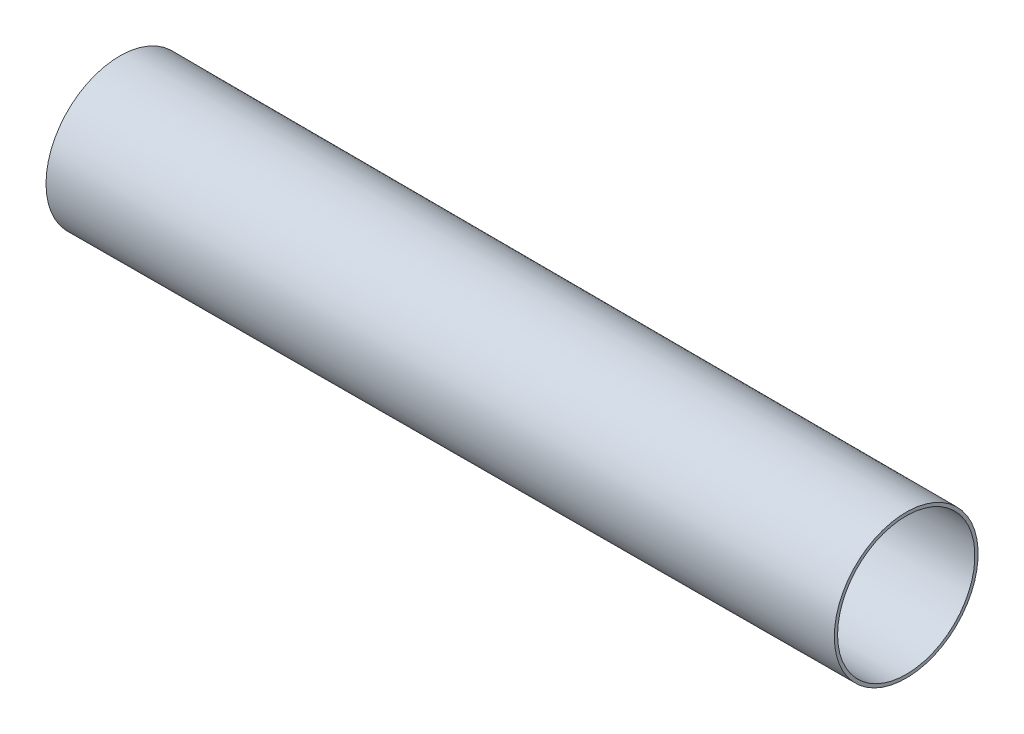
ISO-10303-21;
HEADER;
FILE_DESCRIPTION(('STEP AP214'),'2;1');
FILE_NAME('part.step','',(''),(''),'','','');
FILE_SCHEMA(('AUTOMOTIVE_DESIGN { 1 0 10303 214 1 1 1 1 }'));
ENDSEC;
DATA;
#1=APPLICATION_CONTEXT('core data for automotive mechanical design processes');
#2=APPLICATION_PROTOCOL_DEFINITION('international standard','automotive_design',2000,#1);
#3=PRODUCT_CONTEXT('',#1,'mechanical');
#4=PRODUCT('Part','Part','',(#3));
#5=PRODUCT_RELATED_PRODUCT_CATEGORY('part','',(#4));
#6=PRODUCT_DEFINITION_FORMATION('','',#4);
#7=PRODUCT_DEFINITION_CONTEXT('part definition',#1,'design');
#8=PRODUCT_DEFINITION('design','',#6,#7);
#9=PRODUCT_DEFINITION_SHAPE('','',#8);
#10=(LENGTH_UNIT() NAMED_UNIT(*) SI_UNIT(.MILLI.,.METRE.));
#11=(NAMED_UNIT(*) PLANE_ANGLE_UNIT() SI_UNIT($,.RADIAN.));
#12=(NAMED_UNIT(*) SI_UNIT($,.STERADIAN.) SOLID_ANGLE_UNIT());
#13=UNCERTAINTY_MEASURE_WITH_UNIT(LENGTH_MEASURE(1.E-05),#10,'distance_accuracy_value','');
#14=(GEOMETRIC_REPRESENTATION_CONTEXT(3) GLOBAL_UNCERTAINTY_ASSIGNED_CONTEXT((#13)) GLOBAL_UNIT_ASSIGNED_CONTEXT((#10,
#11,#12)) REPRESENTATION_CONTEXT('',''));
#15=CARTESIAN_POINT('',(0.,0.,0.));
#16=DIRECTION('',(0.,0.,1.));
#17=DIRECTION('',(1.,0.,0.));
#18=AXIS2_PLACEMENT_3D('',#15,#16,#17);
#19=CARTESIAN_POINT('',(19.05,0.,0.));
#20=DIRECTION('',(-1.,0.,0.));
#21=DIRECTION('',(0.,0.,1.));
#22=AXIS2_PLACEMENT_3D('',#19,#20,#21);
#23=CONICAL_SURFACE('',#22,13.6652,0.0023703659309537);
#24=CARTESIAN_POINT('',(171.45,0.,0.));
#25=DIRECTION('',(-1.,0.,0.));
#26=DIRECTION('',(0.,0.,1.));
#27=AXIS2_PLACEMENT_3D('',#24,#25,#26);
#28=CIRCLE('',#27,13.3039555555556);
#29=CARTESIAN_POINT('',(171.45,0.,13.3039555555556));
#30=VERTEX_POINT('',#29);
#31=EDGE_CURVE('E10',#30,#30,#28,.T.);
#32=ORIENTED_EDGE('',*,*,#31,.F.);
#33=EDGE_LOOP('',(#32));
#34=FACE_BOUND('',#33,.T.);
#35=CARTESIAN_POINT('',(19.05,0.,0.));
#36=DIRECTION('',(-1.,0.,0.));
#37=DIRECTION('',(0.,0.,1.));
#38=AXIS2_PLACEMENT_3D('',#35,#36,#37);
#39=CIRCLE('',#38,13.6652);
#40=CARTESIAN_POINT('',(19.05,0.,13.6652));
#41=VERTEX_POINT('',#40);
#42=EDGE_CURVE('E46',#41,#41,#39,.T.);
#43=ORIENTED_EDGE('',*,*,#42,.T.);
#44=EDGE_LOOP('',(#43));
#45=FACE_BOUND('',#44,.T.);
#46=ADVANCED_FACE('F32',(#34,#45),#23,.F.);
#47=CARTESIAN_POINT('',(171.45,13.3039555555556,0.));
#48=DIRECTION('',(-1.,0.,0.));
#49=DIRECTION('',(0.,0.,1.));
#50=AXIS2_PLACEMENT_3D('',#47,#48,#49);
#51=PLANE('',#50);
#52=CARTESIAN_POINT('',(171.45,0.,0.));
#53=DIRECTION('',(-1.,0.,0.));
#54=DIRECTION('',(0.,0.,1.));
#55=AXIS2_PLACEMENT_3D('',#52,#53,#54);
#56=CIRCLE('',#55,13.9361333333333);
#57=CARTESIAN_POINT('',(171.45,0.,13.9361333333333));
#58=VERTEX_POINT('',#57);
#59=EDGE_CURVE('E38',#58,#58,#56,.T.);
#60=ORIENTED_EDGE('',*,*,#59,.F.);
#61=EDGE_LOOP('',(#60));
#62=FACE_BOUND('',#61,.T.);
#63=ORIENTED_EDGE('',*,*,#31,.T.);
#64=EDGE_LOOP('',(#63));
#65=FACE_BOUND('',#64,.T.);
#66=ADVANCED_FACE('F61',(#62,#65),#51,.F.);
#67=CARTESIAN_POINT('',(171.45,0.,0.));
#68=DIRECTION('',(-1.,0.,0.));
#69=DIRECTION('',(0.,0.,1.));
#70=AXIS2_PLACEMENT_3D('',#67,#68,#69);
#71=CONICAL_SURFACE('',#70,13.9361333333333,0.00237036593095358);
#72=CARTESIAN_POINT('',(19.05,0.,0.));
#73=DIRECTION('',(-1.,0.,0.));
#74=DIRECTION('',(0.,0.,1.));
#75=AXIS2_PLACEMENT_3D('',#72,#73,#74);
#76=CIRCLE('',#75,14.2973777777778);
#77=CARTESIAN_POINT('',(19.05,0.,14.2973777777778));
#78=VERTEX_POINT('',#77);
#79=EDGE_CURVE('E42',#78,#78,#76,.T.);
#80=ORIENTED_EDGE('',*,*,#79,.F.);
#81=EDGE_LOOP('',(#80));
#82=FACE_BOUND('',#81,.T.);
#83=ORIENTED_EDGE('',*,*,#59,.T.);
#84=EDGE_LOOP('',(#83));
#85=FACE_BOUND('',#84,.T.);
#86=ADVANCED_FACE('F56',(#82,#85),#71,.T.);
#87=CARTESIAN_POINT('',(19.05,14.2973777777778,0.));
#88=DIRECTION('',(1.,0.,0.));
#89=DIRECTION('',(0.,0.,-1.));
#90=AXIS2_PLACEMENT_3D('',#87,#88,#89);
#91=PLANE('',#90);
#92=ORIENTED_EDGE('',*,*,#42,.F.);
#93=EDGE_LOOP('',(#92));
#94=FACE_BOUND('',#93,.T.);
#95=ORIENTED_EDGE('',*,*,#79,.T.);
#96=EDGE_LOOP('',(#95));
#97=FACE_BOUND('',#96,.T.);
#98=ADVANCED_FACE('F53',(#94,#97),#91,.F.);
#99=CLOSED_SHELL('',(#46,#66,#86,#98));
#100=MANIFOLD_SOLID_BREP('B2',#99);
#101=ADVANCED_BREP_SHAPE_REPRESENTATION('',(#18,#100),#14);
#102=SHAPE_DEFINITION_REPRESENTATION(#9,#101);
ENDSEC;
END-ISO-10303-21;
